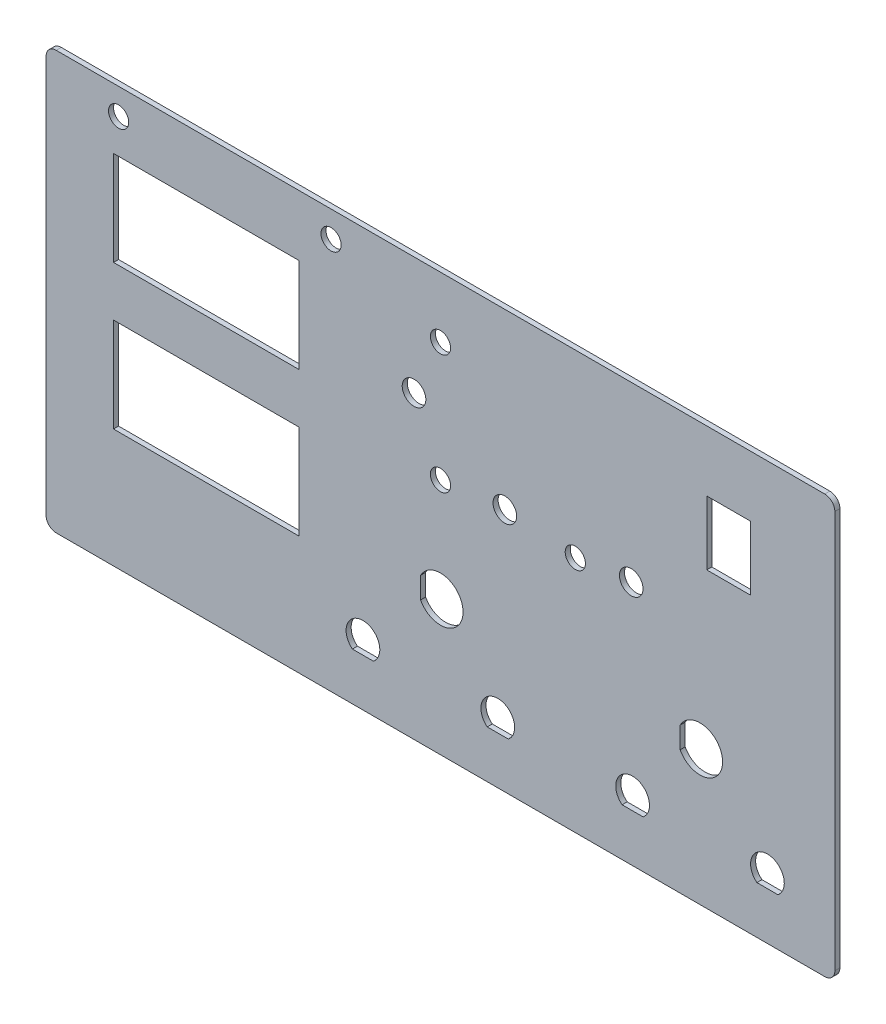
ISO-10303-21;
HEADER;
FILE_DESCRIPTION(('STEP AP214'),'2;1');
FILE_NAME('part.step','',(''),(''),'','','');
FILE_SCHEMA(('AUTOMOTIVE_DESIGN { 1 0 10303 214 1 1 1 1 }'));
ENDSEC;
DATA;
#1=APPLICATION_CONTEXT('core data for automotive mechanical design processes');
#2=APPLICATION_PROTOCOL_DEFINITION('international standard','automotive_design',2000,#1);
#3=PRODUCT_CONTEXT('',#1,'mechanical');
#4=PRODUCT('Part','Part','',(#3));
#5=PRODUCT_RELATED_PRODUCT_CATEGORY('part','',(#4));
#6=PRODUCT_DEFINITION_FORMATION('','',#4);
#7=PRODUCT_DEFINITION_CONTEXT('part definition',#1,'design');
#8=PRODUCT_DEFINITION('design','',#6,#7);
#9=PRODUCT_DEFINITION_SHAPE('','',#8);
#10=(LENGTH_UNIT() NAMED_UNIT(*) SI_UNIT(.MILLI.,.METRE.));
#11=(NAMED_UNIT(*) PLANE_ANGLE_UNIT() SI_UNIT($,.RADIAN.));
#12=(NAMED_UNIT(*) SI_UNIT($,.STERADIAN.) SOLID_ANGLE_UNIT());
#13=UNCERTAINTY_MEASURE_WITH_UNIT(LENGTH_MEASURE(1.E-05),#10,'distance_accuracy_value','');
#14=(GEOMETRIC_REPRESENTATION_CONTEXT(3) GLOBAL_UNCERTAINTY_ASSIGNED_CONTEXT((#13)) GLOBAL_UNIT_ASSIGNED_CONTEXT((#10,
#11,#12)) REPRESENTATION_CONTEXT('',''));
#15=CARTESIAN_POINT('',(0.,0.,0.));
#16=DIRECTION('',(0.,0.,1.));
#17=DIRECTION('',(1.,0.,0.));
#18=AXIS2_PLACEMENT_3D('',#15,#16,#17);
#19=CARTESIAN_POINT('',(-114.,121.,1.5));
#20=DIRECTION('',(0.,0.,1.));
#21=DIRECTION('',(1.,0.,0.));
#22=AXIS2_PLACEMENT_3D('',#19,#20,#21);
#23=PLANE('',#22);
#24=CARTESIAN_POINT('',(56.5950731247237,72.6414940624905,1.5));
#25=DIRECTION('',(0.,0.,1.));
#26=DIRECTION('',(1.,0.,0.));
#27=AXIS2_PLACEMENT_3D('',#24,#25,#26);
#28=CIRCLE('',#27,3.5);
#29=CARTESIAN_POINT('',(60.0950731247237,72.6414940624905,1.5));
#30=VERTEX_POINT('',#29);
#31=EDGE_CURVE('E714',#30,#30,#28,.T.);
#32=ORIENTED_EDGE('',*,*,#31,.F.);
#33=EDGE_LOOP('',(#32));
#34=FACE_BOUND('',#33,.T.);
#35=CARTESIAN_POINT('',(19.0951903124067,72.5477440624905,1.5));
#36=DIRECTION('',(0.,0.,1.));
#37=DIRECTION('',(1.,0.,0.));
#38=AXIS2_PLACEMENT_3D('',#35,#36,#37);
#39=CIRCLE('',#38,3.5);
#40=CARTESIAN_POINT('',(22.5951903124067,72.5477440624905,1.5));
#41=VERTEX_POINT('',#40);
#42=EDGE_CURVE('E718',#41,#41,#39,.T.);
#43=ORIENTED_EDGE('',*,*,#42,.F.);
#44=EDGE_LOOP('',(#43));
#45=FACE_BOUND('',#44,.T.);
#46=CARTESIAN_POINT('',(-7.84622562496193,89.0804421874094,1.5));
#47=DIRECTION('',(0.,0.,1.));
#48=DIRECTION('',(1.,0.,0.));
#49=AXIS2_PLACEMENT_3D('',#46,#47,#48);
#50=CIRCLE('',#49,3.5);
#51=CARTESIAN_POINT('',(-4.34622562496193,89.0804421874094,1.5));
#52=VERTEX_POINT('',#51);
#53=EDGE_CURVE('E727',#52,#52,#50,.T.);
#54=ORIENTED_EDGE('',*,*,#53,.F.);
#55=EDGE_LOOP('',(#54));
#56=FACE_BOUND('',#55,.T.);
#57=CARTESIAN_POINT('',(-32.4641598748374,116.218411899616,1.5));
#58=DIRECTION('',(0.,0.,1.));
#59=DIRECTION('',(1.,0.,0.));
#60=AXIS2_PLACEMENT_3D('',#57,#58,#59);
#61=CIRCLE('',#60,3.);
#62=CARTESIAN_POINT('',(-29.4641598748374,116.218411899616,1.5));
#63=VERTEX_POINT('',#62);
#64=EDGE_CURVE('E733',#63,#63,#61,.T.);
#65=ORIENTED_EDGE('',*,*,#64,.F.);
#66=EDGE_LOOP('',(#65));
#67=FACE_BOUND('',#66,.T.);
#68=CARTESIAN_POINT('',(-95.4817068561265,116.236108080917,1.5));
#69=DIRECTION('',(0.,0.,1.));
#70=DIRECTION('',(1.,0.,0.));
#71=AXIS2_PLACEMENT_3D('',#68,#69,#70);
#72=CIRCLE('',#71,3.00000000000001);
#73=CARTESIAN_POINT('',(-92.4817068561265,116.236108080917,1.5));
#74=VERTEX_POINT('',#73);
#75=EDGE_CURVE('E738',#74,#74,#72,.T.);
#76=ORIENTED_EDGE('',*,*,#75,.F.);
#77=EDGE_LOOP('',(#76));
#78=FACE_BOUND('',#77,.T.);
#79=DIRECTION('',(1.,0.,0.));
#80=VECTOR('',#79,1.);
#81=CARTESIAN_POINT('',(-19.8711024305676,14.1,1.5));
#82=LINE('',#81,#80);
#83=CARTESIAN_POINT('',(-26.1288975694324,14.1,1.5));
#84=VERTEX_POINT('',#83);
#85=CARTESIAN_POINT('',(-19.8711024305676,14.1,1.5));
#86=VERTEX_POINT('',#85);
#87=EDGE_CURVE('E263',#84,#86,#82,.T.);
#88=ORIENTED_EDGE('',*,*,#87,.F.);
#89=CARTESIAN_POINT('',(-23.,18.,1.5));
#90=DIRECTION('',(0.,0.,1.));
#91=DIRECTION('',(-1.,0.,0.));
#92=AXIS2_PLACEMENT_3D('',#89,#90,#91);
#93=CIRCLE('',#92,5.);
#94=EDGE_CURVE('E260',#86,#84,#93,.T.);
#95=ORIENTED_EDGE('',*,*,#94,.F.);
#96=EDGE_LOOP('',(#88,#95));
#97=FACE_BOUND('',#96,.T.);
#98=DIRECTION('',(1.,0.,0.));
#99=VECTOR('',#98,1.);
#100=CARTESIAN_POINT('',(53.8711024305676,14.1,1.5));
#101=LINE('',#100,#99);
#102=CARTESIAN_POINT('',(53.8711024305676,14.1,1.5));
#103=VERTEX_POINT('',#102);
#104=CARTESIAN_POINT('',(60.1288975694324,14.1,1.5));
#105=VERTEX_POINT('',#104);
#106=EDGE_CURVE('E297',#103,#105,#101,.T.);
#107=ORIENTED_EDGE('',*,*,#106,.F.);
#108=CARTESIAN_POINT('',(57.,18.,1.5));
#109=DIRECTION('',(0.,0.,1.));
#110=DIRECTION('',(-1.,0.,0.));
#111=AXIS2_PLACEMENT_3D('',#108,#109,#110);
#112=CIRCLE('',#111,4.99999999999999);
#113=EDGE_CURVE('E294',#105,#103,#112,.T.);
#114=ORIENTED_EDGE('',*,*,#113,.F.);
#115=EDGE_LOOP('',(#107,#114));
#116=FACE_BOUND('',#115,.T.);
#117=DIRECTION('',(1.,0.,0.));
#118=VECTOR('',#117,1.);
#119=CARTESIAN_POINT('',(13.8711024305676,14.1,1.5));
#120=LINE('',#119,#118);
#121=CARTESIAN_POINT('',(13.8711024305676,14.1,1.5));
#122=VERTEX_POINT('',#121);
#123=CARTESIAN_POINT('',(20.1288975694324,14.1,1.5));
#124=VERTEX_POINT('',#123);
#125=EDGE_CURVE('E320',#122,#124,#120,.T.);
#126=ORIENTED_EDGE('',*,*,#125,.F.);
#127=CARTESIAN_POINT('',(17.,18.,1.5));
#128=DIRECTION('',(0.,0.,1.));
#129=DIRECTION('',(-1.,0.,0.));
#130=AXIS2_PLACEMENT_3D('',#127,#128,#129);
#131=CIRCLE('',#130,4.99999999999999);
#132=EDGE_CURVE('E317',#124,#122,#131,.T.);
#133=ORIENTED_EDGE('',*,*,#132,.F.);
#134=EDGE_LOOP('',(#126,#133));
#135=FACE_BOUND('',#134,.T.);
#136=CARTESIAN_POINT('',(0.,70.5999999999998,1.5));
#137=DIRECTION('',(0.,0.,1.));
#138=DIRECTION('',(1.,0.,0.));
#139=AXIS2_PLACEMENT_3D('',#136,#137,#138);
#140=CIRCLE('',#139,3.);
#141=CARTESIAN_POINT('',(3.,70.5999999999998,1.5));
#142=VERTEX_POINT('',#141);
#143=EDGE_CURVE('E340',#142,#142,#140,.T.);
#144=ORIENTED_EDGE('',*,*,#143,.F.);
#145=EDGE_LOOP('',(#144));
#146=FACE_BOUND('',#145,.T.);
#147=DIRECTION('',(1.,0.,0.));
#148=VECTOR('',#147,1.);
#149=CARTESIAN_POINT('',(79.,87.,1.5));
#150=LINE('',#149,#148);
#151=CARTESIAN_POINT('',(79.,87.,1.5));
#152=VERTEX_POINT('',#151);
#153=CARTESIAN_POINT('',(92.,87.,1.5));
#154=VERTEX_POINT('',#153);
#155=EDGE_CURVE('E365',#152,#154,#150,.T.);
#156=ORIENTED_EDGE('',*,*,#155,.F.);
#157=DIRECTION('',(0.,-1.,0.));
#158=VECTOR('',#157,1.);
#159=CARTESIAN_POINT('',(79.,106.,1.5));
#160=LINE('',#159,#158);
#161=CARTESIAN_POINT('',(79.,106.,1.5));
#162=VERTEX_POINT('',#161);
#163=EDGE_CURVE('E363',#162,#152,#160,.T.);
#164=ORIENTED_EDGE('',*,*,#163,.F.);
#165=DIRECTION('',(-1.,0.,0.));
#166=VECTOR('',#165,1.);
#167=CARTESIAN_POINT('',(79.,106.,1.5));
#168=LINE('',#167,#166);
#169=CARTESIAN_POINT('',(92.,106.,1.5));
#170=VERTEX_POINT('',#169);
#171=EDGE_CURVE('E371',#170,#162,#168,.T.);
#172=ORIENTED_EDGE('',*,*,#171,.F.);
#173=DIRECTION('',(0.,1.,0.));
#174=VECTOR('',#173,1.);
#175=CARTESIAN_POINT('',(92.,106.,1.5));
#176=LINE('',#175,#174);
#177=EDGE_CURVE('E368',#154,#170,#176,.T.);
#178=ORIENTED_EDGE('',*,*,#177,.F.);
#179=EDGE_LOOP('',(#156,#164,#172,#178));
#180=FACE_BOUND('',#179,.T.);
#181=DIRECTION('',(1.,0.,0.));
#182=VECTOR('',#181,1.);
#183=CARTESIAN_POINT('',(-97.,78.,1.5));
#184=LINE('',#183,#182);
#185=CARTESIAN_POINT('',(-97.,78.,1.5));
#186=VERTEX_POINT('',#185);
#187=CARTESIAN_POINT('',(-42.,78.,1.5));
#188=VERTEX_POINT('',#187);
#189=EDGE_CURVE('E427',#186,#188,#184,.T.);
#190=ORIENTED_EDGE('',*,*,#189,.F.);
#191=DIRECTION('',(0.,-1.,0.));
#192=VECTOR('',#191,1.);
#193=CARTESIAN_POINT('',(-97.,106.,1.5));
#194=LINE('',#193,#192);
#195=CARTESIAN_POINT('',(-97.,106.,1.5));
#196=VERTEX_POINT('',#195);
#197=EDGE_CURVE('E425',#196,#186,#194,.T.);
#198=ORIENTED_EDGE('',*,*,#197,.F.);
#199=DIRECTION('',(-1.,0.,0.));
#200=VECTOR('',#199,1.);
#201=CARTESIAN_POINT('',(-97.,106.,1.5));
#202=LINE('',#201,#200);
#203=CARTESIAN_POINT('',(-42.,106.,1.5));
#204=VERTEX_POINT('',#203);
#205=EDGE_CURVE('E433',#204,#196,#202,.T.);
#206=ORIENTED_EDGE('',*,*,#205,.F.);
#207=DIRECTION('',(0.,1.,0.));
#208=VECTOR('',#207,1.);
#209=CARTESIAN_POINT('',(-42.,106.,1.5));
#210=LINE('',#209,#208);
#211=EDGE_CURVE('E430',#188,#204,#210,.T.);
#212=ORIENTED_EDGE('',*,*,#211,.F.);
#213=EDGE_LOOP('',(#190,#198,#206,#212));
#214=FACE_BOUND('',#213,.T.);
#215=CARTESIAN_POINT('',(-114.,121.,1.5));
#216=DIRECTION('',(0.,0.,1.));
#217=DIRECTION('',(1.,0.,0.));
#218=AXIS2_PLACEMENT_3D('',#215,#216,#217);
#219=CIRCLE('',#218,3.00000000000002);
#220=CARTESIAN_POINT('',(-114.,124.,1.5));
#221=VERTEX_POINT('',#220);
#222=CARTESIAN_POINT('',(-117.,121.,1.5));
#223=VERTEX_POINT('',#222);
#224=EDGE_CURVE('E456',#221,#223,#219,.T.);
#225=ORIENTED_EDGE('',*,*,#224,.T.);
#226=DIRECTION('',(0.,-1.,0.));
#227=VECTOR('',#226,1.);
#228=CARTESIAN_POINT('',(-117.,121.,1.5));
#229=LINE('',#228,#227);
#230=CARTESIAN_POINT('',(-117.,3.,1.5));
#231=VERTEX_POINT('',#230);
#232=EDGE_CURVE('E459',#223,#231,#229,.T.);
#233=ORIENTED_EDGE('',*,*,#232,.T.);
#234=CARTESIAN_POINT('',(-114.,3.,1.5));
#235=DIRECTION('',(0.,0.,1.));
#236=DIRECTION('',(1.,0.,0.));
#237=AXIS2_PLACEMENT_3D('',#234,#235,#236);
#238=CIRCLE('',#237,3.);
#239=CARTESIAN_POINT('',(-114.,0.,1.5));
#240=VERTEX_POINT('',#239);
#241=EDGE_CURVE('E462',#231,#240,#238,.T.);
#242=ORIENTED_EDGE('',*,*,#241,.T.);
#243=DIRECTION('',(1.,0.,0.));
#244=VECTOR('',#243,1.);
#245=CARTESIAN_POINT('',(-114.,0.,1.5));
#246=LINE('',#245,#244);
#247=CARTESIAN_POINT('',(114.,0.,1.5));
#248=VERTEX_POINT('',#247);
#249=EDGE_CURVE('E464',#240,#248,#246,.T.);
#250=ORIENTED_EDGE('',*,*,#249,.T.);
#251=CARTESIAN_POINT('',(114.,3.,1.5));
#252=DIRECTION('',(0.,0.,1.));
#253=DIRECTION('',(1.,0.,0.));
#254=AXIS2_PLACEMENT_3D('',#251,#252,#253);
#255=CIRCLE('',#254,3.);
#256=CARTESIAN_POINT('',(117.,3.,1.5));
#257=VERTEX_POINT('',#256);
#258=EDGE_CURVE('E466',#248,#257,#255,.T.);
#259=ORIENTED_EDGE('',*,*,#258,.T.);
#260=DIRECTION('',(0.,1.,0.));
#261=VECTOR('',#260,1.);
#262=CARTESIAN_POINT('',(117.,121.,1.5));
#263=LINE('',#262,#261);
#264=CARTESIAN_POINT('',(117.,121.,1.5));
#265=VERTEX_POINT('',#264);
#266=EDGE_CURVE('E468',#257,#265,#263,.T.);
#267=ORIENTED_EDGE('',*,*,#266,.T.);
#268=CARTESIAN_POINT('',(114.,121.,1.5));
#269=DIRECTION('',(0.,0.,1.));
#270=DIRECTION('',(-1.,0.,0.));
#271=AXIS2_PLACEMENT_3D('',#268,#269,#270);
#272=CIRCLE('',#271,3.00000000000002);
#273=CARTESIAN_POINT('',(114.,124.,1.5));
#274=VERTEX_POINT('',#273);
#275=EDGE_CURVE('E470',#265,#274,#272,.T.);
#276=ORIENTED_EDGE('',*,*,#275,.T.);
#277=DIRECTION('',(-1.,0.,0.));
#278=VECTOR('',#277,1.);
#279=CARTESIAN_POINT('',(-114.,124.,1.5));
#280=LINE('',#279,#278);
#281=EDGE_CURVE('E472',#274,#221,#280,.T.);
#282=ORIENTED_EDGE('',*,*,#281,.T.);
#283=EDGE_LOOP('',(#225,#233,#242,#250,#259,#267,#276,#282));
#284=FACE_BOUND('',#283,.T.);
#285=DIRECTION('',(1.,0.,0.));
#286=VECTOR('',#285,1.);
#287=CARTESIAN_POINT('',(-97.,35.1999999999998,1.5));
#288=LINE('',#287,#286);
#289=CARTESIAN_POINT('',(-97.,35.1999999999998,1.5));
#290=VERTEX_POINT('',#289);
#291=CARTESIAN_POINT('',(-42.,35.1999999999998,1.5));
#292=VERTEX_POINT('',#291);
#293=EDGE_CURVE('E396',#290,#292,#288,.T.);
#294=ORIENTED_EDGE('',*,*,#293,.F.);
#295=DIRECTION('',(0.,-1.,0.));
#296=VECTOR('',#295,1.);
#297=CARTESIAN_POINT('',(-97.,63.2,1.5));
#298=LINE('',#297,#296);
#299=CARTESIAN_POINT('',(-97.,63.2,1.5));
#300=VERTEX_POINT('',#299);
#301=EDGE_CURVE('E394',#300,#290,#298,.T.);
#302=ORIENTED_EDGE('',*,*,#301,.F.);
#303=DIRECTION('',(-1.,0.,0.));
#304=VECTOR('',#303,1.);
#305=CARTESIAN_POINT('',(-97.,63.2,1.5));
#306=LINE('',#305,#304);
#307=CARTESIAN_POINT('',(-42.,63.2,1.5));
#308=VERTEX_POINT('',#307);
#309=EDGE_CURVE('E402',#308,#300,#306,.T.);
#310=ORIENTED_EDGE('',*,*,#309,.F.);
#311=DIRECTION('',(0.,1.,0.));
#312=VECTOR('',#311,1.);
#313=CARTESIAN_POINT('',(-42.,63.2,1.5));
#314=LINE('',#313,#312);
#315=EDGE_CURVE('E399',#292,#308,#314,.T.);
#316=ORIENTED_EDGE('',*,*,#315,.F.);
#317=EDGE_LOOP('',(#294,#302,#310,#316));
#318=FACE_BOUND('',#317,.T.);
#319=DIRECTION('',(0.,-1.,0.));
#320=VECTOR('',#319,1.);
#321=CARTESIAN_POINT('',(71.1,43.1749015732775,1.5));
#322=LINE('',#321,#320);
#323=CARTESIAN_POINT('',(71.1,43.1749015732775,1.5));
#324=VERTEX_POINT('',#323);
#325=CARTESIAN_POINT('',(71.1,36.8250984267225,1.5));
#326=VERTEX_POINT('',#325);
#327=EDGE_CURVE('E349',#324,#326,#322,.T.);
#328=ORIENTED_EDGE('',*,*,#327,.F.);
#329=CARTESIAN_POINT('',(77.0000000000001,40.,1.5));
#330=DIRECTION('',(0.,0.,1.));
#331=DIRECTION('',(1.,0.,0.));
#332=AXIS2_PLACEMENT_3D('',#329,#330,#331);
#333=CIRCLE('',#332,6.70000000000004);
#334=EDGE_CURVE('E346',#326,#324,#333,.T.);
#335=ORIENTED_EDGE('',*,*,#334,.F.);
#336=EDGE_LOOP('',(#328,#335));
#337=FACE_BOUND('',#336,.T.);
#338=CARTESIAN_POINT('',(40.,70.5999999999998,1.5));
#339=DIRECTION('',(0.,0.,1.));
#340=DIRECTION('',(1.,0.,0.));
#341=AXIS2_PLACEMENT_3D('',#338,#339,#340);
#342=CIRCLE('',#341,3.00000000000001);
#343=CARTESIAN_POINT('',(43.,70.5999999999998,1.5));
#344=VERTEX_POINT('',#343);
#345=EDGE_CURVE('E334',#344,#344,#342,.T.);
#346=ORIENTED_EDGE('',*,*,#345,.F.);
#347=EDGE_LOOP('',(#346));
#348=FACE_BOUND('',#347,.T.);
#349=CARTESIAN_POINT('',(0.,106.,1.5));
#350=DIRECTION('',(0.,0.,1.));
#351=DIRECTION('',(1.,0.,0.));
#352=AXIS2_PLACEMENT_3D('',#349,#350,#351);
#353=CIRCLE('',#352,3.);
#354=CARTESIAN_POINT('',(3.00000000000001,106.,1.5));
#355=VERTEX_POINT('',#354);
#356=EDGE_CURVE('E311',#355,#355,#353,.T.);
#357=ORIENTED_EDGE('',*,*,#356,.F.);
#358=EDGE_LOOP('',(#357));
#359=FACE_BOUND('',#358,.T.);
#360=DIRECTION('',(1.,0.,0.));
#361=VECTOR('',#360,1.);
#362=CARTESIAN_POINT('',(93.8711024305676,14.1,1.5));
#363=LINE('',#362,#361);
#364=CARTESIAN_POINT('',(93.8711024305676,14.1,1.5));
#365=VERTEX_POINT('',#364);
#366=CARTESIAN_POINT('',(100.128897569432,14.1,1.5));
#367=VERTEX_POINT('',#366);
#368=EDGE_CURVE('E280',#365,#367,#363,.T.);
#369=ORIENTED_EDGE('',*,*,#368,.F.);
#370=CARTESIAN_POINT('',(97.,18.,1.5));
#371=DIRECTION('',(0.,0.,1.));
#372=DIRECTION('',(-1.,0.,0.));
#373=AXIS2_PLACEMENT_3D('',#370,#371,#372);
#374=CIRCLE('',#373,4.99999999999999);
#375=EDGE_CURVE('E277',#367,#365,#374,.T.);
#376=ORIENTED_EDGE('',*,*,#375,.F.);
#377=EDGE_LOOP('',(#369,#376));
#378=FACE_BOUND('',#377,.T.);
#379=DIRECTION('',(0.,-1.,0.));
#380=VECTOR('',#379,1.);
#381=CARTESIAN_POINT('',(-5.9,43.1749015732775,1.5));
#382=LINE('',#381,#380);
#383=CARTESIAN_POINT('',(-5.90000000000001,43.1749015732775,1.5));
#384=VERTEX_POINT('',#383);
#385=CARTESIAN_POINT('',(-5.9,36.8250984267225,1.5));
#386=VERTEX_POINT('',#385);
#387=EDGE_CURVE('E240',#384,#386,#382,.T.);
#388=ORIENTED_EDGE('',*,*,#387,.F.);
#389=CARTESIAN_POINT('',(0.,40.,1.5));
#390=DIRECTION('',(0.,0.,1.));
#391=DIRECTION('',(1.,0.,0.));
#392=AXIS2_PLACEMENT_3D('',#389,#390,#391);
#393=CIRCLE('',#392,6.7);
#394=EDGE_CURVE('E246',#386,#384,#393,.T.);
#395=ORIENTED_EDGE('',*,*,#394,.F.);
#396=EDGE_LOOP('',(#388,#395));
#397=FACE_BOUND('',#396,.T.);
#398=ADVANCED_FACE('F32',(#34,#45,#56,#67,#78,#97,#116,#135,#146,#180,#214,#284,#318,#337,#348,
#359,#378,#397),#23,.T.);
#399=CARTESIAN_POINT('',(-114.,121.,0.));
#400=DIRECTION('',(0.,0.,1.));
#401=DIRECTION('',(1.,0.,0.));
#402=AXIS2_PLACEMENT_3D('',#399,#400,#401);
#403=PLANE('',#402);
#404=CARTESIAN_POINT('',(56.5950731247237,72.6414940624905,0.));
#405=DIRECTION('',(0.,0.,1.));
#406=DIRECTION('',(1.,0.,0.));
#407=AXIS2_PLACEMENT_3D('',#404,#405,#406);
#408=CIRCLE('',#407,3.5);
#409=CARTESIAN_POINT('',(60.0950731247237,72.6414940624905,0.));
#410=VERTEX_POINT('',#409);
#411=EDGE_CURVE('E717',#410,#410,#408,.F.);
#412=ORIENTED_EDGE('',*,*,#411,.F.);
#413=EDGE_LOOP('',(#412));
#414=FACE_BOUND('',#413,.T.);
#415=CARTESIAN_POINT('',(19.0951903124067,72.5477440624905,0.));
#416=DIRECTION('',(0.,0.,1.));
#417=DIRECTION('',(1.,0.,0.));
#418=AXIS2_PLACEMENT_3D('',#415,#416,#417);
#419=CIRCLE('',#418,3.5);
#420=CARTESIAN_POINT('',(22.5951903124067,72.5477440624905,0.));
#421=VERTEX_POINT('',#420);
#422=EDGE_CURVE('E721',#421,#421,#419,.F.);
#423=ORIENTED_EDGE('',*,*,#422,.F.);
#424=EDGE_LOOP('',(#423));
#425=FACE_BOUND('',#424,.T.);
#426=CARTESIAN_POINT('',(-7.84622562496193,89.0804421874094,0.));
#427=DIRECTION('',(0.,0.,1.));
#428=DIRECTION('',(1.,0.,0.));
#429=AXIS2_PLACEMENT_3D('',#426,#427,#428);
#430=CIRCLE('',#429,3.5);
#431=CARTESIAN_POINT('',(-4.34622562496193,89.0804421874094,0.));
#432=VERTEX_POINT('',#431);
#433=EDGE_CURVE('E730',#432,#432,#430,.F.);
#434=ORIENTED_EDGE('',*,*,#433,.F.);
#435=EDGE_LOOP('',(#434));
#436=FACE_BOUND('',#435,.T.);
#437=CARTESIAN_POINT('',(-32.4641598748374,116.218411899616,0.));
#438=DIRECTION('',(0.,0.,1.));
#439=DIRECTION('',(1.,0.,0.));
#440=AXIS2_PLACEMENT_3D('',#437,#438,#439);
#441=CIRCLE('',#440,3.);
#442=CARTESIAN_POINT('',(-29.4641598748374,116.218411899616,0.));
#443=VERTEX_POINT('',#442);
#444=EDGE_CURVE('E736',#443,#443,#441,.F.);
#445=ORIENTED_EDGE('',*,*,#444,.F.);
#446=EDGE_LOOP('',(#445));
#447=FACE_BOUND('',#446,.T.);
#448=CARTESIAN_POINT('',(-95.4817068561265,116.236108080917,0.));
#449=DIRECTION('',(0.,0.,1.));
#450=DIRECTION('',(1.,0.,0.));
#451=AXIS2_PLACEMENT_3D('',#448,#449,#450);
#452=CIRCLE('',#451,3.00000000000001);
#453=CARTESIAN_POINT('',(-92.4817068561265,116.236108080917,0.));
#454=VERTEX_POINT('',#453);
#455=EDGE_CURVE('E254',#454,#454,#452,.F.);
#456=ORIENTED_EDGE('',*,*,#455,.F.);
#457=EDGE_LOOP('',(#456));
#458=FACE_BOUND('',#457,.T.);
#459=CARTESIAN_POINT('',(-23.,18.,0.));
#460=DIRECTION('',(0.,0.,1.));
#461=DIRECTION('',(-1.,0.,0.));
#462=AXIS2_PLACEMENT_3D('',#459,#460,#461);
#463=CIRCLE('',#462,5.);
#464=CARTESIAN_POINT('',(-19.8711024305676,14.1,0.));
#465=VERTEX_POINT('',#464);
#466=CARTESIAN_POINT('',(-26.1288975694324,14.1,0.));
#467=VERTEX_POINT('',#466);
#468=EDGE_CURVE('E259',#465,#467,#463,.T.);
#469=ORIENTED_EDGE('',*,*,#468,.T.);
#470=DIRECTION('',(1.,0.,0.));
#471=VECTOR('',#470,1.);
#472=CARTESIAN_POINT('',(-19.8711024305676,14.1,0.));
#473=LINE('',#472,#471);
#474=EDGE_CURVE('E264',#467,#465,#473,.T.);
#475=ORIENTED_EDGE('',*,*,#474,.T.);
#476=EDGE_LOOP('',(#469,#475));
#477=FACE_BOUND('',#476,.T.);
#478=CARTESIAN_POINT('',(57.,18.,0.));
#479=DIRECTION('',(0.,0.,1.));
#480=DIRECTION('',(-1.,0.,0.));
#481=AXIS2_PLACEMENT_3D('',#478,#479,#480);
#482=CIRCLE('',#481,4.99999999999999);
#483=CARTESIAN_POINT('',(60.1288975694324,14.1,0.));
#484=VERTEX_POINT('',#483);
#485=CARTESIAN_POINT('',(53.8711024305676,14.1,0.));
#486=VERTEX_POINT('',#485);
#487=EDGE_CURVE('E293',#484,#486,#482,.T.);
#488=ORIENTED_EDGE('',*,*,#487,.T.);
#489=DIRECTION('',(1.,0.,0.));
#490=VECTOR('',#489,1.);
#491=CARTESIAN_POINT('',(53.8711024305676,14.1,0.));
#492=LINE('',#491,#490);
#493=EDGE_CURVE('E298',#486,#484,#492,.T.);
#494=ORIENTED_EDGE('',*,*,#493,.T.);
#495=EDGE_LOOP('',(#488,#494));
#496=FACE_BOUND('',#495,.T.);
#497=CARTESIAN_POINT('',(17.,18.,0.));
#498=DIRECTION('',(0.,0.,1.));
#499=DIRECTION('',(-1.,0.,0.));
#500=AXIS2_PLACEMENT_3D('',#497,#498,#499);
#501=CIRCLE('',#500,4.99999999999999);
#502=CARTESIAN_POINT('',(20.1288975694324,14.1,0.));
#503=VERTEX_POINT('',#502);
#504=CARTESIAN_POINT('',(13.8711024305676,14.1,0.));
#505=VERTEX_POINT('',#504);
#506=EDGE_CURVE('E314',#503,#505,#501,.T.);
#507=ORIENTED_EDGE('',*,*,#506,.T.);
#508=DIRECTION('',(1.,0.,0.));
#509=VECTOR('',#508,1.);
#510=CARTESIAN_POINT('',(13.8711024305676,14.1,0.));
#511=LINE('',#510,#509);
#512=EDGE_CURVE('E321',#505,#503,#511,.T.);
#513=ORIENTED_EDGE('',*,*,#512,.T.);
#514=EDGE_LOOP('',(#507,#513));
#515=FACE_BOUND('',#514,.T.);
#516=CARTESIAN_POINT('',(0.,70.5999999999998,0.));
#517=DIRECTION('',(0.,0.,1.));
#518=DIRECTION('',(1.,0.,0.));
#519=AXIS2_PLACEMENT_3D('',#516,#517,#518);
#520=CIRCLE('',#519,3.);
#521=CARTESIAN_POINT('',(3.,70.5999999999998,0.));
#522=VERTEX_POINT('',#521);
#523=EDGE_CURVE('E337',#522,#522,#520,.T.);
#524=ORIENTED_EDGE('',*,*,#523,.T.);
#525=EDGE_LOOP('',(#524));
#526=FACE_BOUND('',#525,.T.);
#527=DIRECTION('',(0.,-1.,0.));
#528=VECTOR('',#527,1.);
#529=CARTESIAN_POINT('',(79.,106.,0.));
#530=LINE('',#529,#528);
#531=CARTESIAN_POINT('',(79.,106.,0.));
#532=VERTEX_POINT('',#531);
#533=CARTESIAN_POINT('',(79.,87.,0.));
#534=VERTEX_POINT('',#533);
#535=EDGE_CURVE('E362',#532,#534,#530,.T.);
#536=ORIENTED_EDGE('',*,*,#535,.T.);
#537=DIRECTION('',(1.,0.,0.));
#538=VECTOR('',#537,1.);
#539=CARTESIAN_POINT('',(79.,87.,0.));
#540=LINE('',#539,#538);
#541=CARTESIAN_POINT('',(92.,87.,0.));
#542=VERTEX_POINT('',#541);
#543=EDGE_CURVE('E376',#534,#542,#540,.T.);
#544=ORIENTED_EDGE('',*,*,#543,.T.);
#545=DIRECTION('',(0.,1.,0.));
#546=VECTOR('',#545,1.);
#547=CARTESIAN_POINT('',(92.,106.,0.));
#548=LINE('',#547,#546);
#549=CARTESIAN_POINT('',(92.,106.,0.));
#550=VERTEX_POINT('',#549);
#551=EDGE_CURVE('E379',#542,#550,#548,.T.);
#552=ORIENTED_EDGE('',*,*,#551,.T.);
#553=DIRECTION('',(-1.,0.,0.));
#554=VECTOR('',#553,1.);
#555=CARTESIAN_POINT('',(79.,106.,0.));
#556=LINE('',#555,#554);
#557=EDGE_CURVE('E366',#550,#532,#556,.T.);
#558=ORIENTED_EDGE('',*,*,#557,.T.);
#559=EDGE_LOOP('',(#536,#544,#552,#558));
#560=FACE_BOUND('',#559,.T.);
#561=DIRECTION('',(0.,-1.,0.));
#562=VECTOR('',#561,1.);
#563=CARTESIAN_POINT('',(-97.,106.,0.));
#564=LINE('',#563,#562);
#565=CARTESIAN_POINT('',(-97.,106.,0.));
#566=VERTEX_POINT('',#565);
#567=CARTESIAN_POINT('',(-97.,78.,0.));
#568=VERTEX_POINT('',#567);
#569=EDGE_CURVE('E424',#566,#568,#564,.T.);
#570=ORIENTED_EDGE('',*,*,#569,.T.);
#571=DIRECTION('',(1.,0.,0.));
#572=VECTOR('',#571,1.);
#573=CARTESIAN_POINT('',(-97.,78.,0.));
#574=LINE('',#573,#572);
#575=CARTESIAN_POINT('',(-42.,78.,0.));
#576=VERTEX_POINT('',#575);
#577=EDGE_CURVE('E438',#568,#576,#574,.T.);
#578=ORIENTED_EDGE('',*,*,#577,.T.);
#579=DIRECTION('',(0.,1.,0.));
#580=VECTOR('',#579,1.);
#581=CARTESIAN_POINT('',(-42.,106.,0.));
#582=LINE('',#581,#580);
#583=CARTESIAN_POINT('',(-42.,106.,0.));
#584=VERTEX_POINT('',#583);
#585=EDGE_CURVE('E441',#576,#584,#582,.T.);
#586=ORIENTED_EDGE('',*,*,#585,.T.);
#587=DIRECTION('',(-1.,0.,0.));
#588=VECTOR('',#587,1.);
#589=CARTESIAN_POINT('',(-97.,106.,0.));
#590=LINE('',#589,#588);
#591=EDGE_CURVE('E428',#584,#566,#590,.T.);
#592=ORIENTED_EDGE('',*,*,#591,.T.);
#593=EDGE_LOOP('',(#570,#578,#586,#592));
#594=FACE_BOUND('',#593,.T.);
#595=CARTESIAN_POINT('',(-114.,121.,0.));
#596=DIRECTION('',(0.,0.,1.));
#597=DIRECTION('',(1.,0.,0.));
#598=AXIS2_PLACEMENT_3D('',#595,#596,#597);
#599=CIRCLE('',#598,3.00000000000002);
#600=CARTESIAN_POINT('',(-114.,124.,0.));
#601=VERTEX_POINT('',#600);
#602=CARTESIAN_POINT('',(-117.,121.,0.));
#603=VERTEX_POINT('',#602);
#604=EDGE_CURVE('E455',#601,#603,#599,.T.);
#605=ORIENTED_EDGE('',*,*,#604,.F.);
#606=DIRECTION('',(-1.,0.,0.));
#607=VECTOR('',#606,1.);
#608=CARTESIAN_POINT('',(-114.,124.,0.));
#609=LINE('',#608,#607);
#610=CARTESIAN_POINT('',(114.,124.,0.));
#611=VERTEX_POINT('',#610);
#612=EDGE_CURVE('E460',#611,#601,#609,.T.);
#613=ORIENTED_EDGE('',*,*,#612,.F.);
#614=CARTESIAN_POINT('',(114.,121.,0.));
#615=DIRECTION('',(0.,0.,1.));
#616=DIRECTION('',(-1.,0.,0.));
#617=AXIS2_PLACEMENT_3D('',#614,#615,#616);
#618=CIRCLE('',#617,3.00000000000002);
#619=CARTESIAN_POINT('',(117.,121.,0.));
#620=VERTEX_POINT('',#619);
#621=EDGE_CURVE('E487',#620,#611,#618,.T.);
#622=ORIENTED_EDGE('',*,*,#621,.F.);
#623=DIRECTION('',(0.,1.,0.));
#624=VECTOR('',#623,1.);
#625=CARTESIAN_POINT('',(117.,121.,0.));
#626=LINE('',#625,#624);
#627=CARTESIAN_POINT('',(117.,3.,0.));
#628=VERTEX_POINT('',#627);
#629=EDGE_CURVE('E485',#628,#620,#626,.T.);
#630=ORIENTED_EDGE('',*,*,#629,.F.);
#631=CARTESIAN_POINT('',(114.,3.,0.));
#632=DIRECTION('',(0.,0.,1.));
#633=DIRECTION('',(1.,0.,0.));
#634=AXIS2_PLACEMENT_3D('',#631,#632,#633);
#635=CIRCLE('',#634,3.);
#636=CARTESIAN_POINT('',(114.,0.,0.));
#637=VERTEX_POINT('',#636);
#638=EDGE_CURVE('E483',#637,#628,#635,.T.);
#639=ORIENTED_EDGE('',*,*,#638,.F.);
#640=DIRECTION('',(1.,0.,0.));
#641=VECTOR('',#640,1.);
#642=CARTESIAN_POINT('',(-114.,0.,0.));
#643=LINE('',#642,#641);
#644=CARTESIAN_POINT('',(-114.,0.,0.));
#645=VERTEX_POINT('',#644);
#646=EDGE_CURVE('E481',#645,#637,#643,.T.);
#647=ORIENTED_EDGE('',*,*,#646,.F.);
#648=CARTESIAN_POINT('',(-114.,3.,0.));
#649=DIRECTION('',(0.,0.,1.));
#650=DIRECTION('',(1.,0.,0.));
#651=AXIS2_PLACEMENT_3D('',#648,#649,#650);
#652=CIRCLE('',#651,3.);
#653=CARTESIAN_POINT('',(-117.,3.,0.));
#654=VERTEX_POINT('',#653);
#655=EDGE_CURVE('E479',#654,#645,#652,.T.);
#656=ORIENTED_EDGE('',*,*,#655,.F.);
#657=DIRECTION('',(0.,-1.,0.));
#658=VECTOR('',#657,1.);
#659=CARTESIAN_POINT('',(-117.,121.,0.));
#660=LINE('',#659,#658);
#661=EDGE_CURVE('E477',#603,#654,#660,.T.);
#662=ORIENTED_EDGE('',*,*,#661,.F.);
#663=EDGE_LOOP('',(#605,#613,#622,#630,#639,#647,#656,#662));
#664=FACE_BOUND('',#663,.T.);
#665=DIRECTION('',(0.,-1.,0.));
#666=VECTOR('',#665,1.);
#667=CARTESIAN_POINT('',(-97.,63.2,0.));
#668=LINE('',#667,#666);
#669=CARTESIAN_POINT('',(-97.,63.2,0.));
#670=VERTEX_POINT('',#669);
#671=CARTESIAN_POINT('',(-97.,35.1999999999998,0.));
#672=VERTEX_POINT('',#671);
#673=EDGE_CURVE('E393',#670,#672,#668,.T.);
#674=ORIENTED_EDGE('',*,*,#673,.T.);
#675=DIRECTION('',(1.,0.,0.));
#676=VECTOR('',#675,1.);
#677=CARTESIAN_POINT('',(-97.,35.1999999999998,0.));
#678=LINE('',#677,#676);
#679=CARTESIAN_POINT('',(-42.,35.1999999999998,0.));
#680=VERTEX_POINT('',#679);
#681=EDGE_CURVE('E407',#672,#680,#678,.T.);
#682=ORIENTED_EDGE('',*,*,#681,.T.);
#683=DIRECTION('',(0.,1.,0.));
#684=VECTOR('',#683,1.);
#685=CARTESIAN_POINT('',(-42.,63.2,0.));
#686=LINE('',#685,#684);
#687=CARTESIAN_POINT('',(-42.,63.2,0.));
#688=VERTEX_POINT('',#687);
#689=EDGE_CURVE('E410',#680,#688,#686,.T.);
#690=ORIENTED_EDGE('',*,*,#689,.T.);
#691=DIRECTION('',(-1.,0.,0.));
#692=VECTOR('',#691,1.);
#693=CARTESIAN_POINT('',(-97.,63.2,0.));
#694=LINE('',#693,#692);
#695=EDGE_CURVE('E397',#688,#670,#694,.T.);
#696=ORIENTED_EDGE('',*,*,#695,.T.);
#697=EDGE_LOOP('',(#674,#682,#690,#696));
#698=FACE_BOUND('',#697,.T.);
#699=CARTESIAN_POINT('',(77.0000000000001,40.,0.));
#700=DIRECTION('',(0.,0.,1.));
#701=DIRECTION('',(1.,0.,0.));
#702=AXIS2_PLACEMENT_3D('',#699,#700,#701);
#703=CIRCLE('',#702,6.70000000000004);
#704=CARTESIAN_POINT('',(71.1,36.8250984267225,0.));
#705=VERTEX_POINT('',#704);
#706=CARTESIAN_POINT('',(71.1,43.1749015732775,0.));
#707=VERTEX_POINT('',#706);
#708=EDGE_CURVE('E343',#705,#707,#703,.T.);
#709=ORIENTED_EDGE('',*,*,#708,.T.);
#710=DIRECTION('',(0.,-1.,0.));
#711=VECTOR('',#710,1.);
#712=CARTESIAN_POINT('',(71.1,43.1749015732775,0.));
#713=LINE('',#712,#711);
#714=EDGE_CURVE('E350',#707,#705,#713,.T.);
#715=ORIENTED_EDGE('',*,*,#714,.T.);
#716=EDGE_LOOP('',(#709,#715));
#717=FACE_BOUND('',#716,.T.);
#718=CARTESIAN_POINT('',(40.,70.5999999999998,0.));
#719=DIRECTION('',(0.,0.,1.));
#720=DIRECTION('',(1.,0.,0.));
#721=AXIS2_PLACEMENT_3D('',#718,#719,#720);
#722=CIRCLE('',#721,3.00000000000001);
#723=CARTESIAN_POINT('',(43.,70.5999999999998,0.));
#724=VERTEX_POINT('',#723);
#725=EDGE_CURVE('E333',#724,#724,#722,.T.);
#726=ORIENTED_EDGE('',*,*,#725,.T.);
#727=EDGE_LOOP('',(#726));
#728=FACE_BOUND('',#727,.T.);
#729=CARTESIAN_POINT('',(0.,106.,0.));
#730=DIRECTION('',(0.,0.,1.));
#731=DIRECTION('',(1.,0.,0.));
#732=AXIS2_PLACEMENT_3D('',#729,#730,#731);
#733=CIRCLE('',#732,3.);
#734=CARTESIAN_POINT('',(3.00000000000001,106.,0.));
#735=VERTEX_POINT('',#734);
#736=EDGE_CURVE('E310',#735,#735,#733,.T.);
#737=ORIENTED_EDGE('',*,*,#736,.T.);
#738=EDGE_LOOP('',(#737));
#739=FACE_BOUND('',#738,.T.);
#740=CARTESIAN_POINT('',(97.,18.,0.));
#741=DIRECTION('',(0.,0.,1.));
#742=DIRECTION('',(-1.,0.,0.));
#743=AXIS2_PLACEMENT_3D('',#740,#741,#742);
#744=CIRCLE('',#743,4.99999999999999);
#745=CARTESIAN_POINT('',(100.128897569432,14.1,0.));
#746=VERTEX_POINT('',#745);
#747=CARTESIAN_POINT('',(93.8711024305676,14.1,0.));
#748=VERTEX_POINT('',#747);
#749=EDGE_CURVE('E276',#746,#748,#744,.T.);
#750=ORIENTED_EDGE('',*,*,#749,.T.);
#751=DIRECTION('',(1.,0.,0.));
#752=VECTOR('',#751,1.);
#753=CARTESIAN_POINT('',(93.8711024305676,14.1,0.));
#754=LINE('',#753,#752);
#755=EDGE_CURVE('E281',#748,#746,#754,.T.);
#756=ORIENTED_EDGE('',*,*,#755,.T.);
#757=EDGE_LOOP('',(#750,#756));
#758=FACE_BOUND('',#757,.T.);
#759=CARTESIAN_POINT('',(0.,40.,0.));
#760=DIRECTION('',(0.,0.,1.));
#761=DIRECTION('',(1.,0.,0.));
#762=AXIS2_PLACEMENT_3D('',#759,#760,#761);
#763=CIRCLE('',#762,6.7);
#764=CARTESIAN_POINT('',(-5.9,36.8250984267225,0.));
#765=VERTEX_POINT('',#764);
#766=CARTESIAN_POINT('',(-5.9,43.1749015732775,0.));
#767=VERTEX_POINT('',#766);
#768=EDGE_CURVE('E54',#765,#767,#763,.T.);
#769=ORIENTED_EDGE('',*,*,#768,.T.);
#770=DIRECTION('',(0.,-1.,0.));
#771=VECTOR('',#770,1.);
#772=CARTESIAN_POINT('',(-5.9,43.1749015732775,0.));
#773=LINE('',#772,#771);
#774=EDGE_CURVE('E250',#767,#765,#773,.T.);
#775=ORIENTED_EDGE('',*,*,#774,.T.);
#776=EDGE_LOOP('',(#769,#775));
#777=FACE_BOUND('',#776,.T.);
#778=ADVANCED_FACE('F517',(#414,#425,#436,#447,#458,#477,#496,#515,#526,#560,#594,#664,#698,
#717,#728,#739,#758,#777),#403,.F.);
#779=CARTESIAN_POINT('',(-114.,121.,1.5));
#780=DIRECTION('',(0.,0.,-1.));
#781=DIRECTION('',(-1.,0.,0.));
#782=AXIS2_PLACEMENT_3D('',#779,#780,#781);
#783=CYLINDRICAL_SURFACE('',#782,3.00000000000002);
#784=ORIENTED_EDGE('',*,*,#604,.T.);
#785=DIRECTION('',(0.,0.,-1.));
#786=VECTOR('',#785,1.);
#787=CARTESIAN_POINT('',(-117.,121.,1.5));
#788=LINE('',#787,#786);
#789=EDGE_CURVE('E11',#223,#603,#788,.T.);
#790=ORIENTED_EDGE('',*,*,#789,.F.);
#791=ORIENTED_EDGE('',*,*,#224,.F.);
#792=DIRECTION('',(0.,0.,-1.));
#793=VECTOR('',#792,1.);
#794=CARTESIAN_POINT('',(-114.,124.,1.5));
#795=LINE('',#794,#793);
#796=EDGE_CURVE('E474',#221,#601,#795,.T.);
#797=ORIENTED_EDGE('',*,*,#796,.T.);
#798=EDGE_LOOP('',(#784,#790,#791,#797));
#799=FACE_BOUND('',#798,.T.);
#800=ADVANCED_FACE('F34',(#799),#783,.T.);
#801=CARTESIAN_POINT('',(-117.,121.,1.5));
#802=DIRECTION('',(1.,0.,0.));
#803=DIRECTION('',(0.,1.,0.));
#804=AXIS2_PLACEMENT_3D('',#801,#802,#803);
#805=PLANE('',#804);
#806=ORIENTED_EDGE('',*,*,#661,.T.);
#807=DIRECTION('',(0.,0.,-1.));
#808=VECTOR('',#807,1.);
#809=CARTESIAN_POINT('',(-117.,3.,1.5));
#810=LINE('',#809,#808);
#811=EDGE_CURVE('E40',#231,#654,#810,.T.);
#812=ORIENTED_EDGE('',*,*,#811,.F.);
#813=ORIENTED_EDGE('',*,*,#232,.F.);
#814=ORIENTED_EDGE('',*,*,#789,.T.);
#815=EDGE_LOOP('',(#806,#812,#813,#814));
#816=FACE_BOUND('',#815,.T.);
#817=ADVANCED_FACE('F535',(#816),#805,.F.);
#818=CARTESIAN_POINT('',(-114.,3.,1.5));
#819=DIRECTION('',(0.,0.,-1.));
#820=DIRECTION('',(-1.,0.,0.));
#821=AXIS2_PLACEMENT_3D('',#818,#819,#820);
#822=CYLINDRICAL_SURFACE('',#821,3.);
#823=ORIENTED_EDGE('',*,*,#655,.T.);
#824=DIRECTION('',(0.,0.,-1.));
#825=VECTOR('',#824,1.);
#826=CARTESIAN_POINT('',(-114.,0.,1.5));
#827=LINE('',#826,#825);
#828=EDGE_CURVE('E504',#240,#645,#827,.T.);
#829=ORIENTED_EDGE('',*,*,#828,.F.);
#830=ORIENTED_EDGE('',*,*,#241,.F.);
#831=ORIENTED_EDGE('',*,*,#811,.T.);
#832=EDGE_LOOP('',(#823,#829,#830,#831));
#833=FACE_BOUND('',#832,.T.);
#834=ADVANCED_FACE('F511',(#833),#822,.T.);
#835=CARTESIAN_POINT('',(-114.,0.,1.5));
#836=DIRECTION('',(0.,1.,0.));
#837=DIRECTION('',(0.,0.,1.));
#838=AXIS2_PLACEMENT_3D('',#835,#836,#837);
#839=PLANE('',#838);
#840=ORIENTED_EDGE('',*,*,#646,.T.);
#841=DIRECTION('',(0.,0.,-1.));
#842=VECTOR('',#841,1.);
#843=CARTESIAN_POINT('',(114.,0.,1.5));
#844=LINE('',#843,#842);
#845=EDGE_CURVE('E501',#248,#637,#844,.T.);
#846=ORIENTED_EDGE('',*,*,#845,.F.);
#847=ORIENTED_EDGE('',*,*,#249,.F.);
#848=ORIENTED_EDGE('',*,*,#828,.T.);
#849=EDGE_LOOP('',(#840,#846,#847,#848));
#850=FACE_BOUND('',#849,.T.);
#851=ADVANCED_FACE('F523',(#850),#839,.F.);
#852=CARTESIAN_POINT('',(114.,3.,1.5));
#853=DIRECTION('',(0.,0.,-1.));
#854=DIRECTION('',(-1.,0.,0.));
#855=AXIS2_PLACEMENT_3D('',#852,#853,#854);
#856=CYLINDRICAL_SURFACE('',#855,3.);
#857=ORIENTED_EDGE('',*,*,#638,.T.);
#858=DIRECTION('',(0.,0.,-1.));
#859=VECTOR('',#858,1.);
#860=CARTESIAN_POINT('',(117.,3.,1.5));
#861=LINE('',#860,#859);
#862=EDGE_CURVE('E498',#257,#628,#861,.T.);
#863=ORIENTED_EDGE('',*,*,#862,.F.);
#864=ORIENTED_EDGE('',*,*,#258,.F.);
#865=ORIENTED_EDGE('',*,*,#845,.T.);
#866=EDGE_LOOP('',(#857,#863,#864,#865));
#867=FACE_BOUND('',#866,.T.);
#868=ADVANCED_FACE('F527',(#867),#856,.T.);
#869=CARTESIAN_POINT('',(117.,121.,1.5));
#870=DIRECTION('',(-1.,0.,0.));
#871=DIRECTION('',(0.,-1.,0.));
#872=AXIS2_PLACEMENT_3D('',#869,#870,#871);
#873=PLANE('',#872);
#874=ORIENTED_EDGE('',*,*,#629,.T.);
#875=DIRECTION('',(0.,0.,-1.));
#876=VECTOR('',#875,1.);
#877=CARTESIAN_POINT('',(117.,121.,1.5));
#878=LINE('',#877,#876);
#879=EDGE_CURVE('E495',#265,#620,#878,.T.);
#880=ORIENTED_EDGE('',*,*,#879,.F.);
#881=ORIENTED_EDGE('',*,*,#266,.F.);
#882=ORIENTED_EDGE('',*,*,#862,.T.);
#883=EDGE_LOOP('',(#874,#880,#881,#882));
#884=FACE_BOUND('',#883,.T.);
#885=ADVANCED_FACE('F548',(#884),#873,.F.);
#886=CARTESIAN_POINT('',(114.,121.,1.5));
#887=DIRECTION('',(0.,0.,-1.));
#888=DIRECTION('',(-1.,0.,0.));
#889=AXIS2_PLACEMENT_3D('',#886,#887,#888);
#890=CYLINDRICAL_SURFACE('',#889,3.00000000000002);
#891=ORIENTED_EDGE('',*,*,#621,.T.);
#892=DIRECTION('',(0.,0.,-1.));
#893=VECTOR('',#892,1.);
#894=CARTESIAN_POINT('',(114.,124.,1.5));
#895=LINE('',#894,#893);
#896=EDGE_CURVE('E492',#274,#611,#895,.T.);
#897=ORIENTED_EDGE('',*,*,#896,.F.);
#898=ORIENTED_EDGE('',*,*,#275,.F.);
#899=ORIENTED_EDGE('',*,*,#879,.T.);
#900=EDGE_LOOP('',(#891,#897,#898,#899));
#901=FACE_BOUND('',#900,.T.);
#902=ADVANCED_FACE('F546',(#901),#890,.T.);
#903=CARTESIAN_POINT('',(-114.,124.,1.5));
#904=DIRECTION('',(0.,-1.,0.));
#905=DIRECTION('',(0.,0.,-1.));
#906=AXIS2_PLACEMENT_3D('',#903,#904,#905);
#907=PLANE('',#906);
#908=ORIENTED_EDGE('',*,*,#612,.T.);
#909=ORIENTED_EDGE('',*,*,#796,.F.);
#910=ORIENTED_EDGE('',*,*,#281,.F.);
#911=ORIENTED_EDGE('',*,*,#896,.T.);
#912=EDGE_LOOP('',(#908,#909,#910,#911));
#913=FACE_BOUND('',#912,.T.);
#914=ADVANCED_FACE('F541',(#913),#907,.F.);
#915=CARTESIAN_POINT('',(-97.,106.,1.5));
#916=DIRECTION('',(1.,0.,0.));
#917=DIRECTION('',(0.,0.,-1.));
#918=AXIS2_PLACEMENT_3D('',#915,#916,#917);
#919=PLANE('',#918);
#920=ORIENTED_EDGE('',*,*,#569,.F.);
#921=DIRECTION('',(0.,0.,-1.));
#922=VECTOR('',#921,1.);
#923=CARTESIAN_POINT('',(-97.,106.,1.5));
#924=LINE('',#923,#922);
#925=EDGE_CURVE('E435',#196,#566,#924,.T.);
#926=ORIENTED_EDGE('',*,*,#925,.F.);
#927=ORIENTED_EDGE('',*,*,#197,.T.);
#928=DIRECTION('',(0.,0.,-1.));
#929=VECTOR('',#928,1.);
#930=CARTESIAN_POINT('',(-97.,78.,1.5));
#931=LINE('',#930,#929);
#932=EDGE_CURVE('E452',#186,#568,#931,.T.);
#933=ORIENTED_EDGE('',*,*,#932,.T.);
#934=EDGE_LOOP('',(#920,#926,#927,#933));
#935=FACE_BOUND('',#934,.T.);
#936=ADVANCED_FACE('F568',(#935),#919,.T.);
#937=CARTESIAN_POINT('',(-97.,78.,1.5));
#938=DIRECTION('',(0.,1.,0.));
#939=DIRECTION('',(0.,0.,1.));
#940=AXIS2_PLACEMENT_3D('',#937,#938,#939);
#941=PLANE('',#940);
#942=ORIENTED_EDGE('',*,*,#577,.F.);
#943=ORIENTED_EDGE('',*,*,#932,.F.);
#944=ORIENTED_EDGE('',*,*,#189,.T.);
#945=DIRECTION('',(0.,0.,-1.));
#946=VECTOR('',#945,1.);
#947=CARTESIAN_POINT('',(-42.,78.,1.5));
#948=LINE('',#947,#946);
#949=EDGE_CURVE('E450',#188,#576,#948,.T.);
#950=ORIENTED_EDGE('',*,*,#949,.T.);
#951=EDGE_LOOP('',(#942,#943,#944,#950));
#952=FACE_BOUND('',#951,.T.);
#953=ADVANCED_FACE('F575',(#952),#941,.T.);
#954=CARTESIAN_POINT('',(-42.,106.,1.5));
#955=DIRECTION('',(-1.,0.,0.));
#956=DIRECTION('',(0.,0.,1.));
#957=AXIS2_PLACEMENT_3D('',#954,#955,#956);
#958=PLANE('',#957);
#959=ORIENTED_EDGE('',*,*,#585,.F.);
#960=ORIENTED_EDGE('',*,*,#949,.F.);
#961=ORIENTED_EDGE('',*,*,#211,.T.);
#962=DIRECTION('',(0.,0.,-1.));
#963=VECTOR('',#962,1.);
#964=CARTESIAN_POINT('',(-42.,106.,1.5));
#965=LINE('',#964,#963);
#966=EDGE_CURVE('E448',#204,#584,#965,.T.);
#967=ORIENTED_EDGE('',*,*,#966,.T.);
#968=EDGE_LOOP('',(#959,#960,#961,#967));
#969=FACE_BOUND('',#968,.T.);
#970=ADVANCED_FACE('F580',(#969),#958,.T.);
#971=CARTESIAN_POINT('',(-97.,106.,1.5));
#972=DIRECTION('',(0.,-1.,0.));
#973=DIRECTION('',(0.,0.,-1.));
#974=AXIS2_PLACEMENT_3D('',#971,#972,#973);
#975=PLANE('',#974);
#976=ORIENTED_EDGE('',*,*,#591,.F.);
#977=ORIENTED_EDGE('',*,*,#966,.F.);
#978=ORIENTED_EDGE('',*,*,#205,.T.);
#979=ORIENTED_EDGE('',*,*,#925,.T.);
#980=EDGE_LOOP('',(#976,#977,#978,#979));
#981=FACE_BOUND('',#980,.T.);
#982=ADVANCED_FACE('F588',(#981),#975,.T.);
#983=CARTESIAN_POINT('',(-97.,63.2,1.5));
#984=DIRECTION('',(1.,0.,0.));
#985=DIRECTION('',(0.,1.,0.));
#986=AXIS2_PLACEMENT_3D('',#983,#984,#985);
#987=PLANE('',#986);
#988=ORIENTED_EDGE('',*,*,#673,.F.);
#989=DIRECTION('',(0.,0.,-1.));
#990=VECTOR('',#989,1.);
#991=CARTESIAN_POINT('',(-97.,63.2,1.5));
#992=LINE('',#991,#990);
#993=EDGE_CURVE('E404',#300,#670,#992,.T.);
#994=ORIENTED_EDGE('',*,*,#993,.F.);
#995=ORIENTED_EDGE('',*,*,#301,.T.);
#996=DIRECTION('',(0.,0.,-1.));
#997=VECTOR('',#996,1.);
#998=CARTESIAN_POINT('',(-97.,35.1999999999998,1.5));
#999=LINE('',#998,#997);
#1000=EDGE_CURVE('E421',#290,#672,#999,.T.);
#1001=ORIENTED_EDGE('',*,*,#1000,.T.);
#1002=EDGE_LOOP('',(#988,#994,#995,#1001));
#1003=FACE_BOUND('',#1002,.T.);
#1004=ADVANCED_FACE('F601',(#1003),#987,.T.);
#1005=CARTESIAN_POINT('',(-97.,35.1999999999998,1.5));
#1006=DIRECTION('',(0.,1.,0.));
#1007=DIRECTION('',(0.,0.,1.));
#1008=AXIS2_PLACEMENT_3D('',#1005,#1006,#1007);
#1009=PLANE('',#1008);
#1010=ORIENTED_EDGE('',*,*,#681,.F.);
#1011=ORIENTED_EDGE('',*,*,#1000,.F.);
#1012=ORIENTED_EDGE('',*,*,#293,.T.);
#1013=DIRECTION('',(0.,0.,-1.));
#1014=VECTOR('',#1013,1.);
#1015=CARTESIAN_POINT('',(-42.,35.1999999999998,1.5));
#1016=LINE('',#1015,#1014);
#1017=EDGE_CURVE('E419',#292,#680,#1016,.T.);
#1018=ORIENTED_EDGE('',*,*,#1017,.T.);
#1019=EDGE_LOOP('',(#1010,#1011,#1012,#1018));
#1020=FACE_BOUND('',#1019,.T.);
#1021=ADVANCED_FACE('F606',(#1020),#1009,.T.);
#1022=CARTESIAN_POINT('',(-42.,63.2,1.5));
#1023=DIRECTION('',(-1.,0.,0.));
#1024=DIRECTION('',(0.,-1.,0.));
#1025=AXIS2_PLACEMENT_3D('',#1022,#1023,#1024);
#1026=PLANE('',#1025);
#1027=ORIENTED_EDGE('',*,*,#689,.F.);
#1028=ORIENTED_EDGE('',*,*,#1017,.F.);
#1029=ORIENTED_EDGE('',*,*,#315,.T.);
#1030=DIRECTION('',(0.,0.,-1.));
#1031=VECTOR('',#1030,1.);
#1032=CARTESIAN_POINT('',(-42.,63.2,1.5));
#1033=LINE('',#1032,#1031);
#1034=EDGE_CURVE('E417',#308,#688,#1033,.T.);
#1035=ORIENTED_EDGE('',*,*,#1034,.T.);
#1036=EDGE_LOOP('',(#1027,#1028,#1029,#1035));
#1037=FACE_BOUND('',#1036,.T.);
#1038=ADVANCED_FACE('F610',(#1037),#1026,.T.);
#1039=CARTESIAN_POINT('',(-97.,63.2,1.5));
#1040=DIRECTION('',(0.,-1.,0.));
#1041=DIRECTION('',(0.,0.,-1.));
#1042=AXIS2_PLACEMENT_3D('',#1039,#1040,#1041);
#1043=PLANE('',#1042);
#1044=ORIENTED_EDGE('',*,*,#695,.F.);
#1045=ORIENTED_EDGE('',*,*,#1034,.F.);
#1046=ORIENTED_EDGE('',*,*,#309,.T.);
#1047=ORIENTED_EDGE('',*,*,#993,.T.);
#1048=EDGE_LOOP('',(#1044,#1045,#1046,#1047));
#1049=FACE_BOUND('',#1048,.T.);
#1050=ADVANCED_FACE('F614',(#1049),#1043,.T.);
#1051=CARTESIAN_POINT('',(79.,106.,1.5));
#1052=DIRECTION('',(1.,0.,0.));
#1053=DIRECTION('',(0.,0.,-1.));
#1054=AXIS2_PLACEMENT_3D('',#1051,#1052,#1053);
#1055=PLANE('',#1054);
#1056=ORIENTED_EDGE('',*,*,#535,.F.);
#1057=DIRECTION('',(0.,0.,-1.));
#1058=VECTOR('',#1057,1.);
#1059=CARTESIAN_POINT('',(79.,106.,1.5));
#1060=LINE('',#1059,#1058);
#1061=EDGE_CURVE('E373',#162,#532,#1060,.T.);
#1062=ORIENTED_EDGE('',*,*,#1061,.F.);
#1063=ORIENTED_EDGE('',*,*,#163,.T.);
#1064=DIRECTION('',(0.,0.,-1.));
#1065=VECTOR('',#1064,1.);
#1066=CARTESIAN_POINT('',(79.,87.,1.5));
#1067=LINE('',#1066,#1065);
#1068=EDGE_CURVE('E390',#152,#534,#1067,.T.);
#1069=ORIENTED_EDGE('',*,*,#1068,.T.);
#1070=EDGE_LOOP('',(#1056,#1062,#1063,#1069));
#1071=FACE_BOUND('',#1070,.T.);
#1072=ADVANCED_FACE('F618',(#1071),#1055,.T.);
#1073=CARTESIAN_POINT('',(79.,87.,1.5));
#1074=DIRECTION('',(0.,1.,0.));
#1075=DIRECTION('',(0.,0.,1.));
#1076=AXIS2_PLACEMENT_3D('',#1073,#1074,#1075);
#1077=PLANE('',#1076);
#1078=ORIENTED_EDGE('',*,*,#543,.F.);
#1079=ORIENTED_EDGE('',*,*,#1068,.F.);
#1080=ORIENTED_EDGE('',*,*,#155,.T.);
#1081=DIRECTION('',(0.,0.,-1.));
#1082=VECTOR('',#1081,1.);
#1083=CARTESIAN_POINT('',(92.,87.,1.5));
#1084=LINE('',#1083,#1082);
#1085=EDGE_CURVE('E388',#154,#542,#1084,.T.);
#1086=ORIENTED_EDGE('',*,*,#1085,.T.);
#1087=EDGE_LOOP('',(#1078,#1079,#1080,#1086));
#1088=FACE_BOUND('',#1087,.T.);
#1089=ADVANCED_FACE('F622',(#1088),#1077,.T.);
#1090=CARTESIAN_POINT('',(92.,106.,1.5));
#1091=DIRECTION('',(-1.,0.,0.));
#1092=DIRECTION('',(0.,-1.,0.));
#1093=AXIS2_PLACEMENT_3D('',#1090,#1091,#1092);
#1094=PLANE('',#1093);
#1095=ORIENTED_EDGE('',*,*,#551,.F.);
#1096=ORIENTED_EDGE('',*,*,#1085,.F.);
#1097=ORIENTED_EDGE('',*,*,#177,.T.);
#1098=DIRECTION('',(0.,0.,-1.));
#1099=VECTOR('',#1098,1.);
#1100=CARTESIAN_POINT('',(92.,106.,1.5));
#1101=LINE('',#1100,#1099);
#1102=EDGE_CURVE('E386',#170,#550,#1101,.T.);
#1103=ORIENTED_EDGE('',*,*,#1102,.T.);
#1104=EDGE_LOOP('',(#1095,#1096,#1097,#1103));
#1105=FACE_BOUND('',#1104,.T.);
#1106=ADVANCED_FACE('F626',(#1105),#1094,.T.);
#1107=CARTESIAN_POINT('',(79.,106.,1.5));
#1108=DIRECTION('',(0.,-1.,0.));
#1109=DIRECTION('',(1.,0.,0.));
#1110=AXIS2_PLACEMENT_3D('',#1107,#1108,#1109);
#1111=PLANE('',#1110);
#1112=ORIENTED_EDGE('',*,*,#557,.F.);
#1113=ORIENTED_EDGE('',*,*,#1102,.F.);
#1114=ORIENTED_EDGE('',*,*,#171,.T.);
#1115=ORIENTED_EDGE('',*,*,#1061,.T.);
#1116=EDGE_LOOP('',(#1112,#1113,#1114,#1115));
#1117=FACE_BOUND('',#1116,.T.);
#1118=ADVANCED_FACE('F630',(#1117),#1111,.T.);
#1119=CARTESIAN_POINT('',(77.0000000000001,40.,1.5));
#1120=DIRECTION('',(0.,0.,-1.));
#1121=DIRECTION('',(-1.,0.,0.));
#1122=AXIS2_PLACEMENT_3D('',#1119,#1120,#1121);
#1123=CYLINDRICAL_SURFACE('',#1122,6.70000000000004);
#1124=ORIENTED_EDGE('',*,*,#708,.F.);
#1125=DIRECTION('',(0.,0.,-1.));
#1126=VECTOR('',#1125,1.);
#1127=CARTESIAN_POINT('',(71.1,36.8250984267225,1.5));
#1128=LINE('',#1127,#1126);
#1129=EDGE_CURVE('E352',#326,#705,#1128,.T.);
#1130=ORIENTED_EDGE('',*,*,#1129,.F.);
#1131=ORIENTED_EDGE('',*,*,#334,.T.);
#1132=DIRECTION('',(0.,0.,-1.));
#1133=VECTOR('',#1132,1.);
#1134=CARTESIAN_POINT('',(71.1,43.1749015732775,1.5));
#1135=LINE('',#1134,#1133);
#1136=EDGE_CURVE('E359',#324,#707,#1135,.T.);
#1137=ORIENTED_EDGE('',*,*,#1136,.T.);
#1138=EDGE_LOOP('',(#1124,#1130,#1131,#1137));
#1139=FACE_BOUND('',#1138,.T.);
#1140=ADVANCED_FACE('F634',(#1139),#1123,.F.);
#1141=CARTESIAN_POINT('',(71.1,43.1749015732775,1.5));
#1142=DIRECTION('',(1.,0.,0.));
#1143=DIRECTION('',(0.,0.,-1.));
#1144=AXIS2_PLACEMENT_3D('',#1141,#1142,#1143);
#1145=PLANE('',#1144);
#1146=ORIENTED_EDGE('',*,*,#714,.F.);
#1147=ORIENTED_EDGE('',*,*,#1136,.F.);
#1148=ORIENTED_EDGE('',*,*,#327,.T.);
#1149=ORIENTED_EDGE('',*,*,#1129,.T.);
#1150=EDGE_LOOP('',(#1146,#1147,#1148,#1149));
#1151=FACE_BOUND('',#1150,.T.);
#1152=ADVANCED_FACE('F638',(#1151),#1145,.T.);
#1153=CARTESIAN_POINT('',(0.,70.5999999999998,1.5));
#1154=DIRECTION('',(0.,0.,-1.));
#1155=DIRECTION('',(-1.,0.,0.));
#1156=AXIS2_PLACEMENT_3D('',#1153,#1154,#1155);
#1157=CYLINDRICAL_SURFACE('',#1156,3.);
#1158=ORIENTED_EDGE('',*,*,#143,.T.);
#1159=EDGE_LOOP('',(#1158));
#1160=FACE_BOUND('',#1159,.T.);
#1161=ORIENTED_EDGE('',*,*,#523,.F.);
#1162=EDGE_LOOP('',(#1161));
#1163=FACE_BOUND('',#1162,.T.);
#1164=ADVANCED_FACE('F642',(#1160,#1163),#1157,.F.);
#1165=CARTESIAN_POINT('',(40.,70.5999999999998,1.5));
#1166=DIRECTION('',(0.,0.,-1.));
#1167=DIRECTION('',(-1.,0.,0.));
#1168=AXIS2_PLACEMENT_3D('',#1165,#1166,#1167);
#1169=CYLINDRICAL_SURFACE('',#1168,3.00000000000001);
#1170=ORIENTED_EDGE('',*,*,#345,.T.);
#1171=EDGE_LOOP('',(#1170));
#1172=FACE_BOUND('',#1171,.T.);
#1173=ORIENTED_EDGE('',*,*,#725,.F.);
#1174=EDGE_LOOP('',(#1173));
#1175=FACE_BOUND('',#1174,.T.);
#1176=ADVANCED_FACE('F646',(#1172,#1175),#1169,.F.);
#1177=CARTESIAN_POINT('',(17.,18.,1.5));
#1178=DIRECTION('',(0.,0.,-1.));
#1179=DIRECTION('',(-1.,0.,0.));
#1180=AXIS2_PLACEMENT_3D('',#1177,#1178,#1179);
#1181=CYLINDRICAL_SURFACE('',#1180,4.99999999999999);
#1182=ORIENTED_EDGE('',*,*,#506,.F.);
#1183=DIRECTION('',(0.,0.,-1.));
#1184=VECTOR('',#1183,1.);
#1185=CARTESIAN_POINT('',(20.1288975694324,14.1,1.5));
#1186=LINE('',#1185,#1184);
#1187=EDGE_CURVE('E323',#124,#503,#1186,.T.);
#1188=ORIENTED_EDGE('',*,*,#1187,.F.);
#1189=ORIENTED_EDGE('',*,*,#132,.T.);
#1190=DIRECTION('',(0.,0.,-1.));
#1191=VECTOR('',#1190,1.);
#1192=CARTESIAN_POINT('',(13.8711024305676,14.1,1.5));
#1193=LINE('',#1192,#1191);
#1194=EDGE_CURVE('E330',#122,#505,#1193,.T.);
#1195=ORIENTED_EDGE('',*,*,#1194,.T.);
#1196=EDGE_LOOP('',(#1182,#1188,#1189,#1195));
#1197=FACE_BOUND('',#1196,.T.);
#1198=ADVANCED_FACE('F650',(#1197),#1181,.F.);
#1199=CARTESIAN_POINT('',(13.8711024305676,14.1,1.5));
#1200=DIRECTION('',(0.,1.,0.));
#1201=DIRECTION('',(0.,0.,1.));
#1202=AXIS2_PLACEMENT_3D('',#1199,#1200,#1201);
#1203=PLANE('',#1202);
#1204=ORIENTED_EDGE('',*,*,#512,.F.);
#1205=ORIENTED_EDGE('',*,*,#1194,.F.);
#1206=ORIENTED_EDGE('',*,*,#125,.T.);
#1207=ORIENTED_EDGE('',*,*,#1187,.T.);
#1208=EDGE_LOOP('',(#1204,#1205,#1206,#1207));
#1209=FACE_BOUND('',#1208,.T.);
#1210=ADVANCED_FACE('F654',(#1209),#1203,.T.);
#1211=CARTESIAN_POINT('',(0.,106.,1.5));
#1212=DIRECTION('',(0.,0.,-1.));
#1213=DIRECTION('',(-1.,0.,0.));
#1214=AXIS2_PLACEMENT_3D('',#1211,#1212,#1213);
#1215=CYLINDRICAL_SURFACE('',#1214,3.);
#1216=ORIENTED_EDGE('',*,*,#356,.T.);
#1217=EDGE_LOOP('',(#1216));
#1218=FACE_BOUND('',#1217,.T.);
#1219=ORIENTED_EDGE('',*,*,#736,.F.);
#1220=EDGE_LOOP('',(#1219));
#1221=FACE_BOUND('',#1220,.T.);
#1222=ADVANCED_FACE('F658',(#1218,#1221),#1215,.F.);
#1223=CARTESIAN_POINT('',(57.,18.,1.5));
#1224=DIRECTION('',(0.,0.,-1.));
#1225=DIRECTION('',(-1.,0.,0.));
#1226=AXIS2_PLACEMENT_3D('',#1223,#1224,#1225);
#1227=CYLINDRICAL_SURFACE('',#1226,4.99999999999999);
#1228=ORIENTED_EDGE('',*,*,#487,.F.);
#1229=DIRECTION('',(0.,0.,-1.));
#1230=VECTOR('',#1229,1.);
#1231=CARTESIAN_POINT('',(60.1288975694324,14.1,1.5));
#1232=LINE('',#1231,#1230);
#1233=EDGE_CURVE('E300',#105,#484,#1232,.T.);
#1234=ORIENTED_EDGE('',*,*,#1233,.F.);
#1235=ORIENTED_EDGE('',*,*,#113,.T.);
#1236=DIRECTION('',(0.,0.,-1.));
#1237=VECTOR('',#1236,1.);
#1238=CARTESIAN_POINT('',(53.8711024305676,14.1,1.5));
#1239=LINE('',#1238,#1237);
#1240=EDGE_CURVE('E307',#103,#486,#1239,.T.);
#1241=ORIENTED_EDGE('',*,*,#1240,.T.);
#1242=EDGE_LOOP('',(#1228,#1234,#1235,#1241));
#1243=FACE_BOUND('',#1242,.T.);
#1244=ADVANCED_FACE('F662',(#1243),#1227,.F.);
#1245=CARTESIAN_POINT('',(53.8711024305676,14.1,1.5));
#1246=DIRECTION('',(0.,1.,0.));
#1247=DIRECTION('',(0.,0.,1.));
#1248=AXIS2_PLACEMENT_3D('',#1245,#1246,#1247);
#1249=PLANE('',#1248);
#1250=ORIENTED_EDGE('',*,*,#493,.F.);
#1251=ORIENTED_EDGE('',*,*,#1240,.F.);
#1252=ORIENTED_EDGE('',*,*,#106,.T.);
#1253=ORIENTED_EDGE('',*,*,#1233,.T.);
#1254=EDGE_LOOP('',(#1250,#1251,#1252,#1253));
#1255=FACE_BOUND('',#1254,.T.);
#1256=ADVANCED_FACE('F666',(#1255),#1249,.T.);
#1257=CARTESIAN_POINT('',(97.,18.,1.5));
#1258=DIRECTION('',(0.,0.,-1.));
#1259=DIRECTION('',(-1.,0.,0.));
#1260=AXIS2_PLACEMENT_3D('',#1257,#1258,#1259);
#1261=CYLINDRICAL_SURFACE('',#1260,4.99999999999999);
#1262=ORIENTED_EDGE('',*,*,#749,.F.);
#1263=DIRECTION('',(0.,0.,-1.));
#1264=VECTOR('',#1263,1.);
#1265=CARTESIAN_POINT('',(100.128897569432,14.1,1.5));
#1266=LINE('',#1265,#1264);
#1267=EDGE_CURVE('E283',#367,#746,#1266,.T.);
#1268=ORIENTED_EDGE('',*,*,#1267,.F.);
#1269=ORIENTED_EDGE('',*,*,#375,.T.);
#1270=DIRECTION('',(0.,0.,-1.));
#1271=VECTOR('',#1270,1.);
#1272=CARTESIAN_POINT('',(93.8711024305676,14.1,1.5));
#1273=LINE('',#1272,#1271);
#1274=EDGE_CURVE('E290',#365,#748,#1273,.T.);
#1275=ORIENTED_EDGE('',*,*,#1274,.T.);
#1276=EDGE_LOOP('',(#1262,#1268,#1269,#1275));
#1277=FACE_BOUND('',#1276,.T.);
#1278=ADVANCED_FACE('F670',(#1277),#1261,.F.);
#1279=CARTESIAN_POINT('',(93.8711024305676,14.1,1.5));
#1280=DIRECTION('',(0.,1.,0.));
#1281=DIRECTION('',(0.,0.,1.));
#1282=AXIS2_PLACEMENT_3D('',#1279,#1280,#1281);
#1283=PLANE('',#1282);
#1284=ORIENTED_EDGE('',*,*,#755,.F.);
#1285=ORIENTED_EDGE('',*,*,#1274,.F.);
#1286=ORIENTED_EDGE('',*,*,#368,.T.);
#1287=ORIENTED_EDGE('',*,*,#1267,.T.);
#1288=EDGE_LOOP('',(#1284,#1285,#1286,#1287));
#1289=FACE_BOUND('',#1288,.T.);
#1290=ADVANCED_FACE('F674',(#1289),#1283,.T.);
#1291=CARTESIAN_POINT('',(-23.,18.,1.5));
#1292=DIRECTION('',(0.,0.,-1.));
#1293=DIRECTION('',(-1.,0.,0.));
#1294=AXIS2_PLACEMENT_3D('',#1291,#1292,#1293);
#1295=CYLINDRICAL_SURFACE('',#1294,5.);
#1296=ORIENTED_EDGE('',*,*,#468,.F.);
#1297=DIRECTION('',(0.,0.,-1.));
#1298=VECTOR('',#1297,1.);
#1299=CARTESIAN_POINT('',(-19.8711024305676,14.1,1.5));
#1300=LINE('',#1299,#1298);
#1301=EDGE_CURVE('E266',#86,#465,#1300,.T.);
#1302=ORIENTED_EDGE('',*,*,#1301,.F.);
#1303=ORIENTED_EDGE('',*,*,#94,.T.);
#1304=DIRECTION('',(0.,0.,-1.));
#1305=VECTOR('',#1304,1.);
#1306=CARTESIAN_POINT('',(-26.1288975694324,14.1,1.5));
#1307=LINE('',#1306,#1305);
#1308=EDGE_CURVE('E273',#84,#467,#1307,.T.);
#1309=ORIENTED_EDGE('',*,*,#1308,.T.);
#1310=EDGE_LOOP('',(#1296,#1302,#1303,#1309));
#1311=FACE_BOUND('',#1310,.T.);
#1312=ADVANCED_FACE('F678',(#1311),#1295,.F.);
#1313=CARTESIAN_POINT('',(-19.8711024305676,14.1,1.5));
#1314=DIRECTION('',(0.,1.,0.));
#1315=DIRECTION('',(-1.,0.,0.));
#1316=AXIS2_PLACEMENT_3D('',#1313,#1314,#1315);
#1317=PLANE('',#1316);
#1318=ORIENTED_EDGE('',*,*,#474,.F.);
#1319=ORIENTED_EDGE('',*,*,#1308,.F.);
#1320=ORIENTED_EDGE('',*,*,#87,.T.);
#1321=ORIENTED_EDGE('',*,*,#1301,.T.);
#1322=EDGE_LOOP('',(#1318,#1319,#1320,#1321));
#1323=FACE_BOUND('',#1322,.T.);
#1324=ADVANCED_FACE('F682',(#1323),#1317,.T.);
#1325=CARTESIAN_POINT('',(0.,40.,1.5));
#1326=DIRECTION('',(0.,0.,-1.));
#1327=DIRECTION('',(-1.,0.,0.));
#1328=AXIS2_PLACEMENT_3D('',#1325,#1326,#1327);
#1329=CYLINDRICAL_SURFACE('',#1328,6.7);
#1330=ORIENTED_EDGE('',*,*,#768,.F.);
#1331=DIRECTION('',(0.,0.,-1.));
#1332=VECTOR('',#1331,1.);
#1333=CARTESIAN_POINT('',(-5.9,36.8250984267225,1.5));
#1334=LINE('',#1333,#1332);
#1335=EDGE_CURVE('E242',#386,#765,#1334,.T.);
#1336=ORIENTED_EDGE('',*,*,#1335,.F.);
#1337=ORIENTED_EDGE('',*,*,#394,.T.);
#1338=DIRECTION('',(0.,0.,-1.));
#1339=VECTOR('',#1338,1.);
#1340=CARTESIAN_POINT('',(-5.9,43.1749015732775,1.5));
#1341=LINE('',#1340,#1339);
#1342=EDGE_CURVE('E47',#384,#767,#1341,.T.);
#1343=ORIENTED_EDGE('',*,*,#1342,.T.);
#1344=EDGE_LOOP('',(#1330,#1336,#1337,#1343));
#1345=FACE_BOUND('',#1344,.T.);
#1346=ADVANCED_FACE('F248',(#1345),#1329,.F.);
#1347=CARTESIAN_POINT('',(-5.9,43.1749015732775,1.5));
#1348=DIRECTION('',(1.,0.,0.));
#1349=DIRECTION('',(0.,1.,0.));
#1350=AXIS2_PLACEMENT_3D('',#1347,#1348,#1349);
#1351=PLANE('',#1350);
#1352=ORIENTED_EDGE('',*,*,#774,.F.);
#1353=ORIENTED_EDGE('',*,*,#1342,.F.);
#1354=ORIENTED_EDGE('',*,*,#387,.T.);
#1355=ORIENTED_EDGE('',*,*,#1335,.T.);
#1356=EDGE_LOOP('',(#1352,#1353,#1354,#1355));
#1357=FACE_BOUND('',#1356,.T.);
#1358=ADVANCED_FACE('F241',(#1357),#1351,.T.);
#1359=CARTESIAN_POINT('',(-95.4817068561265,116.236108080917,-0.000999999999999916));
#1360=DIRECTION('',(0.,0.,1.));
#1361=DIRECTION('',(1.,0.,0.));
#1362=AXIS2_PLACEMENT_3D('',#1359,#1360,#1361);
#1363=CYLINDRICAL_SURFACE('',#1362,3.00000000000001);
#1364=ORIENTED_EDGE('',*,*,#75,.T.);
#1365=EDGE_LOOP('',(#1364));
#1366=FACE_BOUND('',#1365,.T.);
#1367=ORIENTED_EDGE('',*,*,#455,.T.);
#1368=EDGE_LOOP('',(#1367));
#1369=FACE_BOUND('',#1368,.T.);
#1370=ADVANCED_FACE('F691',(#1366,#1369),#1363,.F.);
#1371=CARTESIAN_POINT('',(-32.4641598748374,116.218411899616,-0.000999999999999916));
#1372=DIRECTION('',(0.,0.,1.));
#1373=DIRECTION('',(1.,0.,0.));
#1374=AXIS2_PLACEMENT_3D('',#1371,#1372,#1373);
#1375=CYLINDRICAL_SURFACE('',#1374,3.);
#1376=ORIENTED_EDGE('',*,*,#64,.T.);
#1377=EDGE_LOOP('',(#1376));
#1378=FACE_BOUND('',#1377,.T.);
#1379=ORIENTED_EDGE('',*,*,#444,.T.);
#1380=EDGE_LOOP('',(#1379));
#1381=FACE_BOUND('',#1380,.T.);
#1382=ADVANCED_FACE('F694',(#1378,#1381),#1375,.F.);
#1383=CARTESIAN_POINT('',(-7.84622562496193,89.0804421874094,-0.000999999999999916));
#1384=DIRECTION('',(0.,0.,1.));
#1385=DIRECTION('',(1.,0.,0.));
#1386=AXIS2_PLACEMENT_3D('',#1383,#1384,#1385);
#1387=CYLINDRICAL_SURFACE('',#1386,3.5);
#1388=ORIENTED_EDGE('',*,*,#53,.T.);
#1389=EDGE_LOOP('',(#1388));
#1390=FACE_BOUND('',#1389,.T.);
#1391=ORIENTED_EDGE('',*,*,#433,.T.);
#1392=EDGE_LOOP('',(#1391));
#1393=FACE_BOUND('',#1392,.T.);
#1394=ADVANCED_FACE('F698',(#1390,#1393),#1387,.F.);
#1395=CARTESIAN_POINT('',(19.0951903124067,72.5477440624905,-0.000999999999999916));
#1396=DIRECTION('',(0.,0.,1.));
#1397=DIRECTION('',(1.,0.,0.));
#1398=AXIS2_PLACEMENT_3D('',#1395,#1396,#1397);
#1399=CYLINDRICAL_SURFACE('',#1398,3.5);
#1400=ORIENTED_EDGE('',*,*,#42,.T.);
#1401=EDGE_LOOP('',(#1400));
#1402=FACE_BOUND('',#1401,.T.);
#1403=ORIENTED_EDGE('',*,*,#422,.T.);
#1404=EDGE_LOOP('',(#1403));
#1405=FACE_BOUND('',#1404,.T.);
#1406=ADVANCED_FACE('F702',(#1402,#1405),#1399,.F.);
#1407=CARTESIAN_POINT('',(56.5950731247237,72.6414940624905,-0.000999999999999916));
#1408=DIRECTION('',(0.,0.,1.));
#1409=DIRECTION('',(1.,0.,0.));
#1410=AXIS2_PLACEMENT_3D('',#1407,#1408,#1409);
#1411=CYLINDRICAL_SURFACE('',#1410,3.5);
#1412=ORIENTED_EDGE('',*,*,#31,.T.);
#1413=EDGE_LOOP('',(#1412));
#1414=FACE_BOUND('',#1413,.T.);
#1415=ORIENTED_EDGE('',*,*,#411,.T.);
#1416=EDGE_LOOP('',(#1415));
#1417=FACE_BOUND('',#1416,.T.);
#1418=ADVANCED_FACE('F706',(#1414,#1417),#1411,.F.);
#1419=CLOSED_SHELL('',(#398,#778,#800,#817,#834,#851,#868,#885,#902,#914,#936,#953,#970,#982,
#1004,#1021,#1038,#1050,#1072,#1089,#1106,#1118,#1140,#1152,#1164,#1176,#1198,#1210,#1222,#1244,
#1256,#1278,#1290,#1312,#1324,#1346,#1358,#1370,#1382,#1394,#1406,#1418));
#1420=MANIFOLD_SOLID_BREP('B2',#1419);
#1421=ADVANCED_BREP_SHAPE_REPRESENTATION('',(#18,#1420),#14);
#1422=SHAPE_DEFINITION_REPRESENTATION(#9,#1421);
ENDSEC;
END-ISO-10303-21;
